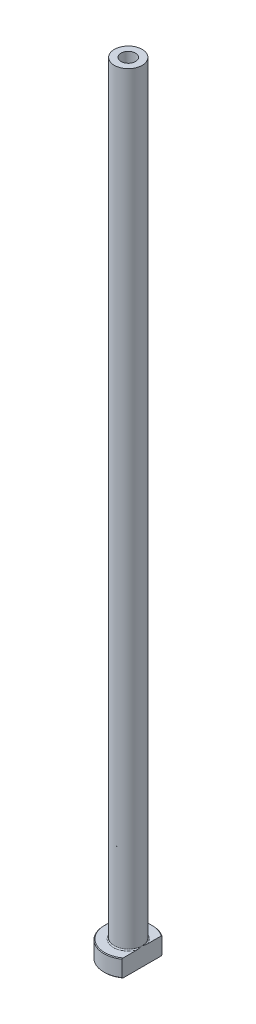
from build123d import *

# Parameters (mm, degrees)
FILLET1_R          = 0.3
CHAMFER1_SIZE      = 0.2
CUT_EXTRUDE1_DEPTH = 226.217672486
CHAMFER2_SIZE      = 0.5


with BuildPart() as part:
    # Sketch1 → Revolve1 (revolve)
    with BuildSketch(Plane.XY, mode=Mode.PRIVATE) as revolve1_sk:
        Polygon((-2.1, 225), (-4, 225), (-4, 5), (-7, 5), (-7, 0), (-2.35, 0), (-2.35, 168), (-2.1, 180), align=None)
    revolve(revolve1_sk.sketch.rotate(Axis((0, 92.187680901, 0), (0, -1, 0)), 270), axis=Axis((0, 92.187680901, 0), (0, -1, 0)))

    # Fillet1
    fillet1_edges = [part.edges().sort_by_distance(p)[0] for p in [
        (0, 5, -4),
    ]]
    fillet(fillet1_edges, radius=FILLET1_R)

    # Chamfer1
    chamfer1_edges = [part.edges().sort_by_distance(p)[0] for p in [
        (0, 0, -7),
        (0, 5, -7),
    ]]
    chamfer(chamfer1_edges, length=CHAMFER1_SIZE)

    # Sketch2 → Cut-Extrude1 (cut, through all)
    with BuildSketch(Plane.XZ):
        with BuildLine():
            Line((4, 5.744562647), (4, -5.744562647))
            ThreePointArc((4, -5.744562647), (7, 0), (4, 5.744562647))
        make_face()
    extrude(amount=-CUT_EXTRUDE1_DEPTH, mode=Mode.SUBTRACT)

    # Chamfer2
    chamfer2_edges = [part.edges().sort_by_distance(p)[0] for p in [
        (0, 0, -2.35),
    ]]
    chamfer(chamfer2_edges, length=CHAMFER2_SIZE)


solid = part.part
